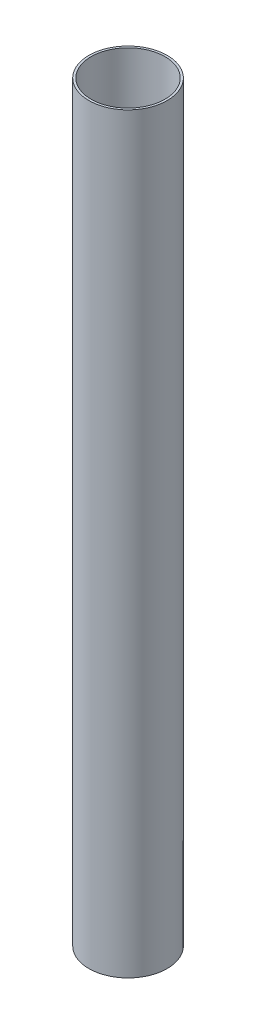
ISO-10303-21;
HEADER;
FILE_DESCRIPTION(('STEP AP214'),'2;1');
FILE_NAME('part.step','',(''),(''),'','','');
FILE_SCHEMA(('AUTOMOTIVE_DESIGN { 1 0 10303 214 1 1 1 1 }'));
ENDSEC;
DATA;
#1=APPLICATION_CONTEXT('core data for automotive mechanical design processes');
#2=APPLICATION_PROTOCOL_DEFINITION('international standard','automotive_design',2000,#1);
#3=PRODUCT_CONTEXT('',#1,'mechanical');
#4=PRODUCT('Part','Part','',(#3));
#5=PRODUCT_RELATED_PRODUCT_CATEGORY('part','',(#4));
#6=PRODUCT_DEFINITION_FORMATION('','',#4);
#7=PRODUCT_DEFINITION_CONTEXT('part definition',#1,'design');
#8=PRODUCT_DEFINITION('design','',#6,#7);
#9=PRODUCT_DEFINITION_SHAPE('','',#8);
#10=(LENGTH_UNIT() NAMED_UNIT(*) SI_UNIT(.MILLI.,.METRE.));
#11=(NAMED_UNIT(*) PLANE_ANGLE_UNIT() SI_UNIT($,.RADIAN.));
#12=(NAMED_UNIT(*) SI_UNIT($,.STERADIAN.) SOLID_ANGLE_UNIT());
#13=UNCERTAINTY_MEASURE_WITH_UNIT(LENGTH_MEASURE(1.E-05),#10,'distance_accuracy_value','');
#14=(GEOMETRIC_REPRESENTATION_CONTEXT(3) GLOBAL_UNCERTAINTY_ASSIGNED_CONTEXT((#13)) GLOBAL_UNIT_ASSIGNED_CONTEXT((#10,
#11,#12)) REPRESENTATION_CONTEXT('',''));
#15=CARTESIAN_POINT('',(0.,0.,0.));
#16=DIRECTION('',(0.,0.,1.));
#17=DIRECTION('',(1.,0.,0.));
#18=AXIS2_PLACEMENT_3D('',#15,#16,#17);
#19=CARTESIAN_POINT('',(0.,304.8,0.));
#20=DIRECTION('',(0.,1.,0.));
#21=DIRECTION('',(0.,0.,1.));
#22=AXIS2_PLACEMENT_3D('',#19,#20,#21);
#23=PLANE('',#22);
#24=CARTESIAN_POINT('',(0.,304.8,0.));
#25=DIRECTION('',(0.,1.,0.));
#26=DIRECTION('',(0.,0.,1.));
#27=AXIS2_PLACEMENT_3D('',#24,#25,#26);
#28=CIRCLE('',#27,15.875);
#29=CARTESIAN_POINT('',(0.,304.8,-15.875));
#30=VERTEX_POINT('',#29);
#31=EDGE_CURVE('E10',#30,#30,#28,.T.);
#32=ORIENTED_EDGE('',*,*,#31,.T.);
#33=EDGE_LOOP('',(#32));
#34=FACE_BOUND('',#33,.T.);
#35=CARTESIAN_POINT('',(0.,304.8,0.));
#36=DIRECTION('',(0.,1.,0.));
#37=DIRECTION('',(0.,0.,1.));
#38=AXIS2_PLACEMENT_3D('',#35,#36,#37);
#39=CIRCLE('',#38,14.986);
#40=CARTESIAN_POINT('',(0.,304.8,-14.986));
#41=VERTEX_POINT('',#40);
#42=EDGE_CURVE('E41',#41,#41,#39,.T.);
#43=ORIENTED_EDGE('',*,*,#42,.F.);
#44=EDGE_LOOP('',(#43));
#45=FACE_BOUND('',#44,.T.);
#46=ADVANCED_FACE('F30',(#34,#45),#23,.T.);
#47=CARTESIAN_POINT('',(0.,0.,0.));
#48=DIRECTION('',(0.,1.,0.));
#49=DIRECTION('',(0.,0.,1.));
#50=AXIS2_PLACEMENT_3D('',#47,#48,#49);
#51=PLANE('',#50);
#52=CARTESIAN_POINT('',(0.,0.,0.));
#53=DIRECTION('',(0.,1.,0.));
#54=DIRECTION('',(0.,0.,1.));
#55=AXIS2_PLACEMENT_3D('',#52,#53,#54);
#56=CIRCLE('',#55,15.875);
#57=CARTESIAN_POINT('',(0.,0.,-15.875));
#58=VERTEX_POINT('',#57);
#59=EDGE_CURVE('E34',#58,#58,#56,.T.);
#60=ORIENTED_EDGE('',*,*,#59,.F.);
#61=EDGE_LOOP('',(#60));
#62=FACE_BOUND('',#61,.T.);
#63=CARTESIAN_POINT('',(0.,0.,0.));
#64=DIRECTION('',(0.,1.,0.));
#65=DIRECTION('',(0.,0.,1.));
#66=AXIS2_PLACEMENT_3D('',#63,#64,#65);
#67=CIRCLE('',#66,14.986);
#68=CARTESIAN_POINT('',(0.,0.,-14.986));
#69=VERTEX_POINT('',#68);
#70=EDGE_CURVE('E43',#69,#69,#67,.T.);
#71=ORIENTED_EDGE('',*,*,#70,.T.);
#72=EDGE_LOOP('',(#71));
#73=FACE_BOUND('',#72,.T.);
#74=ADVANCED_FACE('F53',(#62,#73),#51,.F.);
#75=CARTESIAN_POINT('',(0.,304.8,0.));
#76=DIRECTION('',(0.,-1.,0.));
#77=DIRECTION('',(0.,0.,-1.));
#78=AXIS2_PLACEMENT_3D('',#75,#76,#77);
#79=CYLINDRICAL_SURFACE('',#78,15.875);
#80=CARTESIAN_POINT('',(0.,304.8,-15.875));
#81=CARTESIAN_POINT('',(0.,301.625,-15.875));
#82=CARTESIAN_POINT('',(0.,298.45,-15.875));
#83=CARTESIAN_POINT('',(0.,292.1,-15.875));
#84=CARTESIAN_POINT('',(0.,288.925,-15.875));
#85=CARTESIAN_POINT('',(0.,282.575,-15.875));
#86=CARTESIAN_POINT('',(0.,279.4,-15.875));
#87=CARTESIAN_POINT('',(0.,273.05,-15.875));
#88=CARTESIAN_POINT('',(0.,269.875,-15.875));
#89=CARTESIAN_POINT('',(0.,263.525,-15.875));
#90=CARTESIAN_POINT('',(0.,260.35,-15.875));
#91=CARTESIAN_POINT('',(0.,254.,-15.875));
#92=CARTESIAN_POINT('',(0.,250.825,-15.875));
#93=CARTESIAN_POINT('',(0.,244.475,-15.875));
#94=CARTESIAN_POINT('',(0.,241.3,-15.875));
#95=CARTESIAN_POINT('',(0.,234.95,-15.875));
#96=CARTESIAN_POINT('',(0.,231.775,-15.875));
#97=CARTESIAN_POINT('',(0.,225.425,-15.875));
#98=CARTESIAN_POINT('',(0.,222.25,-15.875));
#99=CARTESIAN_POINT('',(0.,215.9,-15.875));
#100=CARTESIAN_POINT('',(0.,212.725,-15.875));
#101=CARTESIAN_POINT('',(0.,206.375,-15.875));
#102=CARTESIAN_POINT('',(0.,203.2,-15.875));
#103=CARTESIAN_POINT('',(0.,196.85,-15.875));
#104=CARTESIAN_POINT('',(0.,193.675,-15.875));
#105=CARTESIAN_POINT('',(0.,187.325,-15.875));
#106=CARTESIAN_POINT('',(0.,184.15,-15.875));
#107=CARTESIAN_POINT('',(0.,177.8,-15.875));
#108=CARTESIAN_POINT('',(0.,174.625,-15.875));
#109=CARTESIAN_POINT('',(0.,168.275,-15.875));
#110=CARTESIAN_POINT('',(0.,165.1,-15.875));
#111=CARTESIAN_POINT('',(0.,158.75,-15.875));
#112=CARTESIAN_POINT('',(0.,155.575,-15.875));
#113=CARTESIAN_POINT('',(0.,149.225,-15.875));
#114=CARTESIAN_POINT('',(0.,146.05,-15.875));
#115=CARTESIAN_POINT('',(0.,139.7,-15.875));
#116=CARTESIAN_POINT('',(0.,136.525,-15.875));
#117=CARTESIAN_POINT('',(0.,130.175,-15.875));
#118=CARTESIAN_POINT('',(0.,127.,-15.875));
#119=CARTESIAN_POINT('',(0.,120.65,-15.875));
#120=CARTESIAN_POINT('',(0.,117.475,-15.875));
#121=CARTESIAN_POINT('',(0.,111.125,-15.875));
#122=CARTESIAN_POINT('',(0.,107.95,-15.875));
#123=CARTESIAN_POINT('',(0.,101.6,-15.875));
#124=CARTESIAN_POINT('',(0.,98.425,-15.875));
#125=CARTESIAN_POINT('',(0.,92.075,-15.875));
#126=CARTESIAN_POINT('',(0.,88.9,-15.875));
#127=CARTESIAN_POINT('',(0.,82.55,-15.875));
#128=CARTESIAN_POINT('',(0.,79.375,-15.875));
#129=CARTESIAN_POINT('',(0.,73.025,-15.875));
#130=CARTESIAN_POINT('',(0.,69.85,-15.875));
#131=CARTESIAN_POINT('',(0.,63.5,-15.875));
#132=CARTESIAN_POINT('',(0.,60.325,-15.875));
#133=CARTESIAN_POINT('',(0.,53.975,-15.875));
#134=CARTESIAN_POINT('',(0.,50.8,-15.875));
#135=CARTESIAN_POINT('',(0.,44.45,-15.875));
#136=CARTESIAN_POINT('',(0.,41.275,-15.875));
#137=CARTESIAN_POINT('',(0.,34.925,-15.875));
#138=CARTESIAN_POINT('',(0.,31.75,-15.875));
#139=CARTESIAN_POINT('',(0.,25.4,-15.875));
#140=CARTESIAN_POINT('',(0.,22.225,-15.875));
#141=CARTESIAN_POINT('',(0.,15.875,-15.875));
#142=CARTESIAN_POINT('',(0.,12.7,-15.875));
#143=CARTESIAN_POINT('',(0.,6.35,-15.875));
#144=CARTESIAN_POINT('',(0.,3.175,-15.875));
#145=CARTESIAN_POINT('',(0.,0.,-15.875));
#146=B_SPLINE_CURVE_WITH_KNOTS('',3,(#80,#81,#82,#83,#84,#85,#86,#87,#88,#89,#90,#91,#92,#93,
#94,#95,#96,#97,#98,#99,#100,#101,#102,#103,#104,#105,#106,#107,#108,#109,#110,#111,#112,#113,
#114,#115,#116,#117,#118,#119,#120,#121,#122,#123,#124,#125,#126,#127,#128,#129,#130,#131,#132,
#133,#134,#135,#136,#137,#138,#139,#140,#141,#142,#143,#144,#145),.UNSPECIFIED.,.F.,.F.,(4,2,2,
2,2,2,2,2,2,2,2,2,2,2,2,2,2,2,2,2,2,2,2,2,2,2,2,2,2,2,2,2,4),(0.,9.52500000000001,19.05,28.575,
38.1,47.625,57.15,66.675,76.2,85.7250000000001,95.2500000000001,104.775,114.3,123.825,133.35,
142.875,152.4,161.925,171.45,180.975,190.5,200.025,209.55,219.075,228.6,238.125,247.65,257.175,
266.7,276.225,285.75,295.275,304.8),.UNSPECIFIED.);
#147=EDGE_CURVE('BSEAM32',#30,#58,#146,.T.);
#148=ORIENTED_EDGE('',*,*,#31,.F.);
#149=ORIENTED_EDGE('',*,*,#59,.T.);
#150=ORIENTED_EDGE('',*,*,#147,.T.);
#151=ORIENTED_EDGE('',*,*,#147,.F.);
#152=EDGE_LOOP('',(#148,#150,#149,#151));
#153=FACE_BOUND('',#152,.T.);
#154=ADVANCED_FACE('F32',(#153),#79,.T.);
#155=CARTESIAN_POINT('',(0.,304.8,0.));
#156=DIRECTION('',(0.,-1.,0.));
#157=DIRECTION('',(0.,0.,-1.));
#158=AXIS2_PLACEMENT_3D('',#155,#156,#157);
#159=CYLINDRICAL_SURFACE('',#158,14.986);
#160=CARTESIAN_POINT('',(0.,304.8,-14.986));
#161=CARTESIAN_POINT('',(0.,301.625,-14.986));
#162=CARTESIAN_POINT('',(0.,298.45,-14.986));
#163=CARTESIAN_POINT('',(0.,292.1,-14.986));
#164=CARTESIAN_POINT('',(0.,288.925,-14.986));
#165=CARTESIAN_POINT('',(0.,282.575,-14.986));
#166=CARTESIAN_POINT('',(0.,279.4,-14.986));
#167=CARTESIAN_POINT('',(0.,273.05,-14.986));
#168=CARTESIAN_POINT('',(0.,269.875,-14.986));
#169=CARTESIAN_POINT('',(0.,263.525,-14.986));
#170=CARTESIAN_POINT('',(0.,260.35,-14.986));
#171=CARTESIAN_POINT('',(0.,254.,-14.986));
#172=CARTESIAN_POINT('',(0.,250.825,-14.986));
#173=CARTESIAN_POINT('',(0.,244.475,-14.986));
#174=CARTESIAN_POINT('',(0.,241.3,-14.986));
#175=CARTESIAN_POINT('',(0.,234.95,-14.986));
#176=CARTESIAN_POINT('',(0.,231.775,-14.986));
#177=CARTESIAN_POINT('',(0.,225.425,-14.986));
#178=CARTESIAN_POINT('',(0.,222.25,-14.986));
#179=CARTESIAN_POINT('',(0.,215.9,-14.986));
#180=CARTESIAN_POINT('',(0.,212.725,-14.986));
#181=CARTESIAN_POINT('',(0.,206.375,-14.986));
#182=CARTESIAN_POINT('',(0.,203.2,-14.986));
#183=CARTESIAN_POINT('',(0.,196.85,-14.986));
#184=CARTESIAN_POINT('',(0.,193.675,-14.986));
#185=CARTESIAN_POINT('',(0.,187.325,-14.986));
#186=CARTESIAN_POINT('',(0.,184.15,-14.986));
#187=CARTESIAN_POINT('',(0.,177.8,-14.986));
#188=CARTESIAN_POINT('',(0.,174.625,-14.986));
#189=CARTESIAN_POINT('',(0.,168.275,-14.986));
#190=CARTESIAN_POINT('',(0.,165.1,-14.986));
#191=CARTESIAN_POINT('',(0.,158.75,-14.986));
#192=CARTESIAN_POINT('',(0.,155.575,-14.986));
#193=CARTESIAN_POINT('',(0.,149.225,-14.986));
#194=CARTESIAN_POINT('',(0.,146.05,-14.986));
#195=CARTESIAN_POINT('',(0.,139.7,-14.986));
#196=CARTESIAN_POINT('',(0.,136.525,-14.986));
#197=CARTESIAN_POINT('',(0.,130.175,-14.986));
#198=CARTESIAN_POINT('',(0.,127.,-14.986));
#199=CARTESIAN_POINT('',(0.,120.65,-14.986));
#200=CARTESIAN_POINT('',(0.,117.475,-14.986));
#201=CARTESIAN_POINT('',(0.,111.125,-14.986));
#202=CARTESIAN_POINT('',(0.,107.95,-14.986));
#203=CARTESIAN_POINT('',(0.,101.6,-14.986));
#204=CARTESIAN_POINT('',(0.,98.425,-14.986));
#205=CARTESIAN_POINT('',(0.,92.075,-14.986));
#206=CARTESIAN_POINT('',(0.,88.9,-14.986));
#207=CARTESIAN_POINT('',(0.,82.55,-14.986));
#208=CARTESIAN_POINT('',(0.,79.375,-14.986));
#209=CARTESIAN_POINT('',(0.,73.025,-14.986));
#210=CARTESIAN_POINT('',(0.,69.85,-14.986));
#211=CARTESIAN_POINT('',(0.,63.5,-14.986));
#212=CARTESIAN_POINT('',(0.,60.325,-14.986));
#213=CARTESIAN_POINT('',(0.,53.975,-14.986));
#214=CARTESIAN_POINT('',(0.,50.8,-14.986));
#215=CARTESIAN_POINT('',(0.,44.45,-14.986));
#216=CARTESIAN_POINT('',(0.,41.275,-14.986));
#217=CARTESIAN_POINT('',(0.,34.925,-14.986));
#218=CARTESIAN_POINT('',(0.,31.75,-14.986));
#219=CARTESIAN_POINT('',(0.,25.4,-14.986));
#220=CARTESIAN_POINT('',(0.,22.225,-14.986));
#221=CARTESIAN_POINT('',(0.,15.875,-14.986));
#222=CARTESIAN_POINT('',(0.,12.7,-14.986));
#223=CARTESIAN_POINT('',(0.,6.35,-14.986));
#224=CARTESIAN_POINT('',(0.,3.175,-14.986));
#225=CARTESIAN_POINT('',(0.,0.,-14.986));
#226=B_SPLINE_CURVE_WITH_KNOTS('',3,(#160,#161,#162,#163,#164,#165,#166,#167,#168,#169,#170,
#171,#172,#173,#174,#175,#176,#177,#178,#179,#180,#181,#182,#183,#184,#185,#186,#187,#188,#189,
#190,#191,#192,#193,#194,#195,#196,#197,#198,#199,#200,#201,#202,#203,#204,#205,#206,#207,#208,
#209,#210,#211,#212,#213,#214,#215,#216,#217,#218,#219,#220,#221,#222,#223,#224,#225),
.UNSPECIFIED.,.F.,.F.,(4,2,2,2,2,2,2,2,2,2,2,2,2,2,2,2,2,2,2,2,2,2,2,2,2,2,2,2,2,2,2,2,4),(0.,
9.52499999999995,19.05,28.575,38.1,47.625,57.15,66.675,76.2,85.725,95.2499999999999,104.775,
114.3,123.825,133.35,142.875,152.4,161.925,171.45,180.975,190.5,200.025,209.55,219.075,228.6,
238.125,247.65,257.175,266.7,276.225,285.75,295.275,304.8),.UNSPECIFIED.);
#227=EDGE_CURVE('BSEAM49',#41,#69,#226,.T.);
#228=ORIENTED_EDGE('',*,*,#42,.T.);
#229=ORIENTED_EDGE('',*,*,#70,.F.);
#230=ORIENTED_EDGE('',*,*,#227,.T.);
#231=ORIENTED_EDGE('',*,*,#227,.F.);
#232=EDGE_LOOP('',(#228,#230,#229,#231));
#233=FACE_BOUND('',#232,.T.);
#234=ADVANCED_FACE('F49',(#233),#159,.F.);
#235=CLOSED_SHELL('',(#46,#74,#154,#234));
#236=MANIFOLD_SOLID_BREP('B2',#235);
#237=ADVANCED_BREP_SHAPE_REPRESENTATION('',(#18,#236),#14);
#238=SHAPE_DEFINITION_REPRESENTATION(#9,#237);
ENDSEC;
END-ISO-10303-21;
